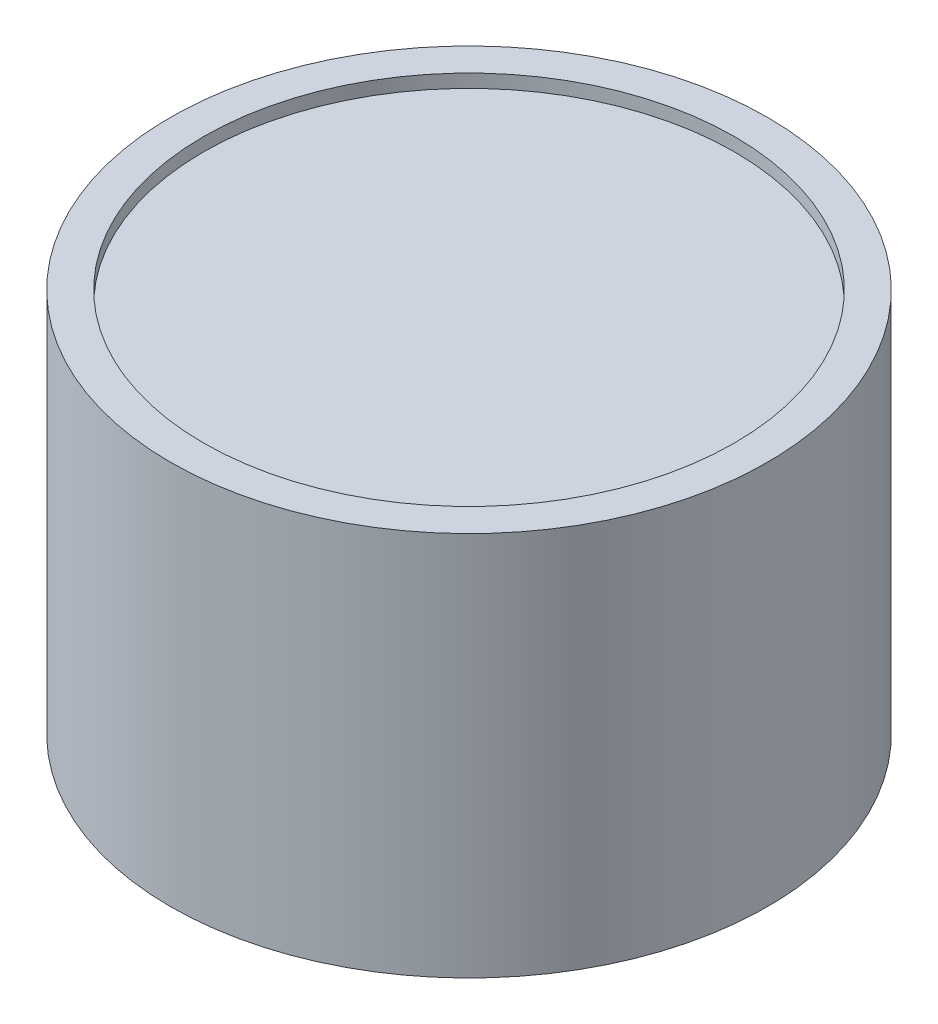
from build123d import *

# Parameters (mm, degrees)
CROQUIS1_R              = 45
SALIENTE_EXTRUIR1_DEPTH = 58
CROQUIS2_R              = 40
CORTAR_EXTRUIR1_DEPTH   = 2


with BuildPart() as part:
    # Croquis1 → Saliente-Extruir1 (new body)
    with BuildSketch(Plane(origin=(0, 0, 0), x_dir=(1, 0, 0), z_dir=(0, 1, 0))):
        with Locations(Location((0, 0, 0), (0, 0, 90))):
            Circle(CROQUIS1_R)
    extrude(amount=SALIENTE_EXTRUIR1_DEPTH)

    # Croquis2 → Cortar-Extruir1 (cut)
    with BuildSketch(Plane(origin=(0, 58, 0), x_dir=(1, 0, 0), z_dir=(0, 1, 0))):
        with Locations(Location((0, 0, 0), (0, 0, 270))):
            Circle(CROQUIS2_R)
    extrude(amount=-CORTAR_EXTRUIR1_DEPTH, mode=Mode.SUBTRACT)


solid = part.part
